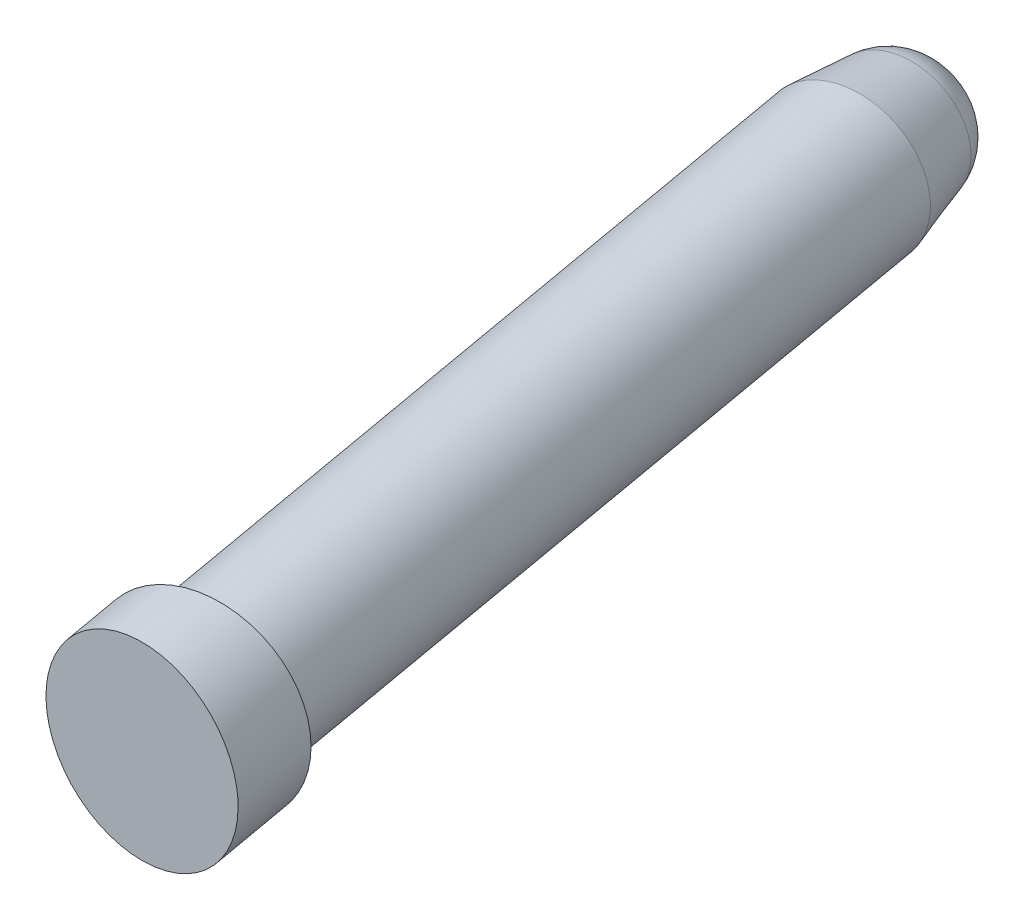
ISO-10303-21;
HEADER;
FILE_DESCRIPTION(('STEP AP214'),'2;1');
FILE_NAME('part.step','',(''),(''),'','','');
FILE_SCHEMA(('AUTOMOTIVE_DESIGN { 1 0 10303 214 1 1 1 1 }'));
ENDSEC;
DATA;
#1=APPLICATION_CONTEXT('core data for automotive mechanical design processes');
#2=APPLICATION_PROTOCOL_DEFINITION('international standard','automotive_design',2000,#1);
#3=PRODUCT_CONTEXT('',#1,'mechanical');
#4=PRODUCT('Part','Part','',(#3));
#5=PRODUCT_RELATED_PRODUCT_CATEGORY('part','',(#4));
#6=PRODUCT_DEFINITION_FORMATION('','',#4);
#7=PRODUCT_DEFINITION_CONTEXT('part definition',#1,'design');
#8=PRODUCT_DEFINITION('design','',#6,#7);
#9=PRODUCT_DEFINITION_SHAPE('','',#8);
#10=(LENGTH_UNIT() NAMED_UNIT(*) SI_UNIT(.MILLI.,.METRE.));
#11=(NAMED_UNIT(*) PLANE_ANGLE_UNIT() SI_UNIT($,.RADIAN.));
#12=(NAMED_UNIT(*) SI_UNIT($,.STERADIAN.) SOLID_ANGLE_UNIT());
#13=UNCERTAINTY_MEASURE_WITH_UNIT(LENGTH_MEASURE(1.E-05),#10,'distance_accuracy_value','');
#14=(GEOMETRIC_REPRESENTATION_CONTEXT(3) GLOBAL_UNCERTAINTY_ASSIGNED_CONTEXT((#13)) GLOBAL_UNIT_ASSIGNED_CONTEXT((#10,
#11,#12)) REPRESENTATION_CONTEXT('',''));
#15=CARTESIAN_POINT('',(0.,0.,0.));
#16=DIRECTION('',(0.,0.,1.));
#17=DIRECTION('',(1.,0.,0.));
#18=AXIS2_PLACEMENT_3D('',#15,#16,#17);
#19=CARTESIAN_POINT('',(-132.790501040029,-41.85,29.1367302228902));
#20=DIRECTION('',(-0.17364817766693,0.,-0.984807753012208));
#21=DIRECTION('',(-0.984807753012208,0.,0.17364817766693));
#22=AXIS2_PLACEMENT_3D('',#19,#20,#21);
#23=PLANE('',#22);
#24=CARTESIAN_POINT('',(-132.790501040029,-41.85,29.1367302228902));
#25=DIRECTION('',(-0.17364817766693,0.,-0.984807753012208));
#26=DIRECTION('',(-0.984807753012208,0.,0.17364817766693));
#27=AXIS2_PLACEMENT_3D('',#24,#25,#26);
#28=CIRCLE('',#27,7.);
#29=CARTESIAN_POINT('',(-139.684155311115,-41.85,30.3522674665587));
#30=VERTEX_POINT('',#29);
#31=EDGE_CURVE('E32',#30,#30,#28,.T.);
#32=ORIENTED_EDGE('',*,*,#31,.F.);
#33=EDGE_LOOP('',(#32));
#34=FACE_BOUND('',#33,.T.);
#35=CARTESIAN_POINT('',(-132.790501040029,-41.85,29.1367302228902));
#36=DIRECTION('',(0.17364817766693,0.,0.984807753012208));
#37=DIRECTION('',(0.984807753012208,0.,-0.17364817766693));
#38=AXIS2_PLACEMENT_3D('',#35,#36,#37);
#39=CIRCLE('',#38,9.);
#40=CARTESIAN_POINT('',(-123.92723126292,-41.85,27.5738966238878));
#41=VERTEX_POINT('',#40);
#42=EDGE_CURVE('E31',#41,#41,#39,.T.);
#43=ORIENTED_EDGE('',*,*,#42,.F.);
#44=EDGE_LOOP('',(#43));
#45=FACE_BOUND('',#44,.T.);
#46=ADVANCED_FACE('F14',(#34,#45),#23,.T.);
#47=CARTESIAN_POINT('',(-132.790501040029,-41.85,29.1367302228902));
#48=DIRECTION('',(0.17364817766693,0.,0.984807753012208));
#49=DIRECTION('',(0.984807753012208,0.,-0.17364817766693));
#50=AXIS2_PLACEMENT_3D('',#47,#48,#49);
#51=CYLINDRICAL_SURFACE('',#50,9.);
#52=CARTESIAN_POINT('',(-131.580321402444,-41.85,36.));
#53=DIRECTION('',(0.,0.,-1.));
#54=DIRECTION('',(1.,0.,0.));
#55=AXIS2_PLACEMENT_3D('',#52,#53,#54);
#56=ELLIPSE('',#55,9.13883950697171,9.);
#57=CARTESIAN_POINT('',(-122.441481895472,-41.85,36.));
#58=VERTEX_POINT('',#57);
#59=EDGE_CURVE('E28',#58,#58,#56,.F.);
#60=ORIENTED_EDGE('',*,*,#59,.F.);
#61=EDGE_LOOP('',(#60));
#62=FACE_BOUND('',#61,.T.);
#63=ORIENTED_EDGE('',*,*,#42,.T.);
#64=EDGE_LOOP('',(#63));
#65=FACE_BOUND('',#64,.T.);
#66=ADVANCED_FACE('F38',(#62,#65),#51,.T.);
#67=CARTESIAN_POINT('',(-147.724244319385,-41.85,-55.5567365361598));
#68=DIRECTION('',(-0.17364817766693,0.,-0.984807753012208));
#69=DIRECTION('',(-0.984807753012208,0.,0.17364817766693));
#70=AXIS2_PLACEMENT_3D('',#67,#68,#69);
#71=PLANE('',#70);
#72=CARTESIAN_POINT('',(-147.724244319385,-41.85,-55.5567365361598));
#73=DIRECTION('',(-0.17364817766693,0.,-0.984807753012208));
#74=DIRECTION('',(-0.984807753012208,0.,0.17364817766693));
#75=AXIS2_PLACEMENT_3D('',#72,#73,#74);
#76=CIRCLE('',#75,0.953068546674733);
#77=CARTESIAN_POINT('',(-148.662833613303,-41.85,-55.3912379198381));
#78=VERTEX_POINT('',#77);
#79=EDGE_CURVE('E22',#78,#78,#76,.T.);
#80=ORIENTED_EDGE('',*,*,#79,.T.);
#81=EDGE_LOOP('',(#80));
#82=FACE_BOUND('',#81,.T.);
#83=ADVANCED_FACE('F47',(#82),#71,.T.);
#84=CARTESIAN_POINT('',(-130.359426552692,-41.85,42.924038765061));
#85=DIRECTION('',(-0.17364817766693,0.,-0.984807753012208));
#86=DIRECTION('',(-0.984807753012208,0.,0.17364817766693));
#87=AXIS2_PLACEMENT_3D('',#84,#85,#86);
#88=CYLINDRICAL_SURFACE('',#87,7.);
#89=CARTESIAN_POINT('',(-145.900938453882,-41.85,-45.2162551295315));
#90=DIRECTION('',(-0.173648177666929,0.,-0.984807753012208));
#91=DIRECTION('',(-0.984807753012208,0.,0.173648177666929));
#92=AXIS2_PLACEMENT_3D('',#89,#90,#91);
#93=CIRCLE('',#92,7.);
#94=CARTESIAN_POINT('',(-152.794592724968,-41.85,-44.000717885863));
#95=VERTEX_POINT('',#94);
#96=EDGE_CURVE('E18',#95,#95,#93,.F.);
#97=CARTESIAN_POINT('',(-152.794592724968,-41.85,-44.000717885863));
#98=CARTESIAN_POINT('',(-152.658025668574,-41.85,-43.2262076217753));
#99=CARTESIAN_POINT('',(-152.521458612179,-41.85,-42.4516973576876));
#100=CARTESIAN_POINT('',(-152.248324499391,-41.85,-40.9026768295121));
#101=CARTESIAN_POINT('',(-152.111757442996,-41.85,-40.1281665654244));
#102=CARTESIAN_POINT('',(-151.838623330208,-41.85,-38.5791460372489));
#103=CARTESIAN_POINT('',(-151.702056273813,-41.85,-37.8046357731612));
#104=CARTESIAN_POINT('',(-151.428922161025,-41.85,-36.2556152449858));
#105=CARTESIAN_POINT('',(-151.292355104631,-41.85,-35.481104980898));
#106=CARTESIAN_POINT('',(-151.019220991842,-41.85,-33.9320844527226));
#107=CARTESIAN_POINT('',(-150.882653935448,-41.85,-33.1575741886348));
#108=CARTESIAN_POINT('',(-150.609519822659,-41.85,-31.6085536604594));
#109=CARTESIAN_POINT('',(-150.472952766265,-41.85,-30.8340433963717));
#110=CARTESIAN_POINT('',(-150.199818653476,-41.85,-29.2850228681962));
#111=CARTESIAN_POINT('',(-150.063251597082,-41.85,-28.5105126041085));
#112=CARTESIAN_POINT('',(-149.790117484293,-41.85,-26.961492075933));
#113=CARTESIAN_POINT('',(-149.653550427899,-41.85,-26.1869818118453));
#114=CARTESIAN_POINT('',(-149.38041631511,-41.85,-24.6379612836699));
#115=CARTESIAN_POINT('',(-149.243849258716,-41.85,-23.8634510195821));
#116=CARTESIAN_POINT('',(-148.970715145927,-41.85,-22.3144304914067));
#117=CARTESIAN_POINT('',(-148.834148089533,-41.85,-21.539920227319));
#118=CARTESIAN_POINT('',(-148.561013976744,-41.85,-19.9908996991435));
#119=CARTESIAN_POINT('',(-148.42444692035,-41.85,-19.2163894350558));
#120=CARTESIAN_POINT('',(-148.151312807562,-41.85,-17.6673689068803));
#121=CARTESIAN_POINT('',(-148.014745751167,-41.85,-16.8928586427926));
#122=CARTESIAN_POINT('',(-147.741611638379,-41.85,-15.3438381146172));
#123=CARTESIAN_POINT('',(-147.605044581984,-41.85,-14.5693278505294));
#124=CARTESIAN_POINT('',(-147.331910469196,-41.85,-13.020307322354));
#125=CARTESIAN_POINT('',(-147.195343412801,-41.85,-12.2457970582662));
#126=CARTESIAN_POINT('',(-146.922209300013,-41.85,-10.6967765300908));
#127=CARTESIAN_POINT('',(-146.785642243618,-41.85,-9.92226626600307));
#128=CARTESIAN_POINT('',(-146.51250813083,-41.85,-8.37324573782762));
#129=CARTESIAN_POINT('',(-146.375941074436,-41.85,-7.59873547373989));
#130=CARTESIAN_POINT('',(-146.102806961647,-41.85,-6.04971494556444));
#131=CARTESIAN_POINT('',(-145.966239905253,-41.85,-5.27520468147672));
#132=CARTESIAN_POINT('',(-145.693105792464,-41.85,-3.72618415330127));
#133=CARTESIAN_POINT('',(-145.55653873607,-41.85,-2.95167388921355));
#134=CARTESIAN_POINT('',(-145.283404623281,-41.85,-1.40265336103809));
#135=CARTESIAN_POINT('',(-145.146837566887,-41.85,-0.628143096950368));
#136=CARTESIAN_POINT('',(-144.873703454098,-41.85,0.920877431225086));
#137=CARTESIAN_POINT('',(-144.737136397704,-41.85,1.69538769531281));
#138=CARTESIAN_POINT('',(-144.464002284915,-41.85,3.24440822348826));
#139=CARTESIAN_POINT('',(-144.327435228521,-41.85,4.01891848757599));
#140=CARTESIAN_POINT('',(-144.054301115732,-41.85,5.56793901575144));
#141=CARTESIAN_POINT('',(-143.917734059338,-41.85,6.34244927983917));
#142=CARTESIAN_POINT('',(-143.644599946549,-41.85,7.89146980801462));
#143=CARTESIAN_POINT('',(-143.508032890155,-41.85,8.66598007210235));
#144=CARTESIAN_POINT('',(-143.234898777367,-41.85,10.2150006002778));
#145=CARTESIAN_POINT('',(-143.098331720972,-41.85,10.9895108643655));
#146=CARTESIAN_POINT('',(-142.825197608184,-41.85,12.538531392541));
#147=CARTESIAN_POINT('',(-142.688630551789,-41.85,13.3130416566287));
#148=CARTESIAN_POINT('',(-142.415496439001,-41.85,14.8620621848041));
#149=CARTESIAN_POINT('',(-142.278929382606,-41.85,15.6365724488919));
#150=CARTESIAN_POINT('',(-142.005795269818,-41.85,17.1855929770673));
#151=CARTESIAN_POINT('',(-141.869228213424,-41.85,17.960103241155));
#152=CARTESIAN_POINT('',(-141.596094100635,-41.85,19.5091237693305));
#153=CARTESIAN_POINT('',(-141.459527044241,-41.85,20.2836340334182));
#154=CARTESIAN_POINT('',(-141.186392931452,-41.85,21.8326545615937));
#155=CARTESIAN_POINT('',(-141.049825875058,-41.85,22.6071648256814));
#156=CARTESIAN_POINT('',(-140.776691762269,-41.85,24.1561853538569));
#157=CARTESIAN_POINT('',(-140.640124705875,-41.85,24.9306956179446));
#158=CARTESIAN_POINT('',(-140.366990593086,-41.85,26.47971614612));
#159=CARTESIAN_POINT('',(-140.230423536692,-41.85,27.2542264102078));
#160=CARTESIAN_POINT('',(-139.957289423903,-41.85,28.8032469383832));
#161=CARTESIAN_POINT('',(-139.820722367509,-41.85,29.5777572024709));
#162=CARTESIAN_POINT('',(-139.684155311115,-41.85,30.3522674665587));
#163=B_SPLINE_CURVE_WITH_KNOTS('',3,(#97,#98,#99,#100,#101,#102,#103,#104,#105,#106,#107,#108,
#109,#110,#111,#112,#113,#114,#115,#116,#117,#118,#119,#120,#121,#122,#123,#124,#125,#126,#127,
#128,#129,#130,#131,#132,#133,#134,#135,#136,#137,#138,#139,#140,#141,#142,#143,#144,#145,#146,
#147,#148,#149,#150,#151,#152,#153,#154,#155,#156,#157,#158,#159,#160,#161,#162),.UNSPECIFIED.,
.F.,.F.,(4,2,2,2,2,2,2,2,2,2,2,2,2,2,2,2,2,2,2,2,2,2,2,2,2,2,2,2,2,2,2,2,4),(0.,2.359375,
4.71874999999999,7.07812499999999,9.43749999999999,11.796875,14.15625,16.515625,18.875,
21.234375,23.59375,25.953125,28.3125,30.671875,33.03125,35.390625,37.75,40.109375,42.46875,
44.828125,47.1875,49.546875,51.90625,54.265625,56.625,58.984375,61.34375,63.703125,66.0625,
68.421875,70.78125,73.140625,75.5),.UNSPECIFIED.);
#164=EDGE_CURVE('BSEAM52',#95,#30,#163,.T.);
#165=ORIENTED_EDGE('',*,*,#96,.T.);
#166=ORIENTED_EDGE('',*,*,#31,.T.);
#167=ORIENTED_EDGE('',*,*,#164,.T.);
#168=ORIENTED_EDGE('',*,*,#164,.F.);
#169=EDGE_LOOP('',(#165,#167,#166,#168));
#170=FACE_BOUND('',#169,.T.);
#171=ADVANCED_FACE('F52',(#170),#88,.T.);
#172=CARTESIAN_POINT('',(-145.900938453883,-41.85,-45.2162551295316));
#173=DIRECTION('',(0.173648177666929,0.,0.984807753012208));
#174=DIRECTION('',(0.984807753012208,0.,-0.173648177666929));
#175=AXIS2_PLACEMENT_3D('',#172,#173,#174);
#176=CONICAL_SURFACE('',#175,7.,0.174532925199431);
#177=CARTESIAN_POINT('',(-147.006771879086,-41.85,-51.4877481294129));
#178=DIRECTION('',(-0.17364817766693,0.,-0.984807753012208));
#179=DIRECTION('',(-0.984807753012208,0.,0.17364817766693));
#180=AXIS2_PLACEMENT_3D('',#177,#178,#179);
#181=CIRCLE('',#180,5.87710731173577);
#182=CARTESIAN_POINT('',(-152.794592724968,-41.85,-50.467199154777));
#183=VERTEX_POINT('',#182);
#184=EDGE_CURVE('E10',#183,#183,#181,.F.);
#185=ORIENTED_EDGE('',*,*,#184,.T.);
#186=EDGE_LOOP('',(#185));
#187=FACE_BOUND('',#186,.T.);
#188=ORIENTED_EDGE('',*,*,#96,.F.);
#189=EDGE_LOOP('',(#188));
#190=FACE_BOUND('',#189,.T.);
#191=ADVANCED_FACE('F55',(#187,#190),#176,.T.);
#192=CARTESIAN_POINT('',(-146.856003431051,-41.85,-50.6326977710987));
#193=DIRECTION('',(-0.17364817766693,0.,-0.984807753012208));
#194=DIRECTION('',(-0.984807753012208,0.,0.17364817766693));
#195=AXIS2_PLACEMENT_3D('',#192,#193,#194);
#196=DEGENERATE_TOROIDAL_SURFACE('',#195,0.953068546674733,5.,.T.);
#197=ORIENTED_EDGE('',*,*,#184,.F.);
#198=EDGE_LOOP('',(#197));
#199=FACE_BOUND('',#198,.T.);
#200=ORIENTED_EDGE('',*,*,#79,.F.);
#201=EDGE_LOOP('',(#200));
#202=FACE_BOUND('',#201,.T.);
#203=ADVANCED_FACE('F16',(#199,#202),#196,.T.);
#204=CARTESIAN_POINT('',(-149.081359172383,-70.4595502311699,36.));
#205=DIRECTION('',(0.,0.,-1.));
#206=DIRECTION('',(-1.,0.,0.));
#207=AXIS2_PLACEMENT_3D('',#204,#205,#206);
#208=PLANE('',#207);
#209=ORIENTED_EDGE('',*,*,#59,.T.);
#210=EDGE_LOOP('',(#209));
#211=FACE_BOUND('',#210,.T.);
#212=ADVANCED_FACE('F66',(#211),#208,.F.);
#213=CLOSED_SHELL('',(#46,#66,#83,#171,#191,#203,#212));
#214=MANIFOLD_SOLID_BREP('B1',#213);
#215=ADVANCED_BREP_SHAPE_REPRESENTATION('',(#18,#214),#14);
#216=SHAPE_DEFINITION_REPRESENTATION(#9,#215);
ENDSEC;
END-ISO-10303-21;
